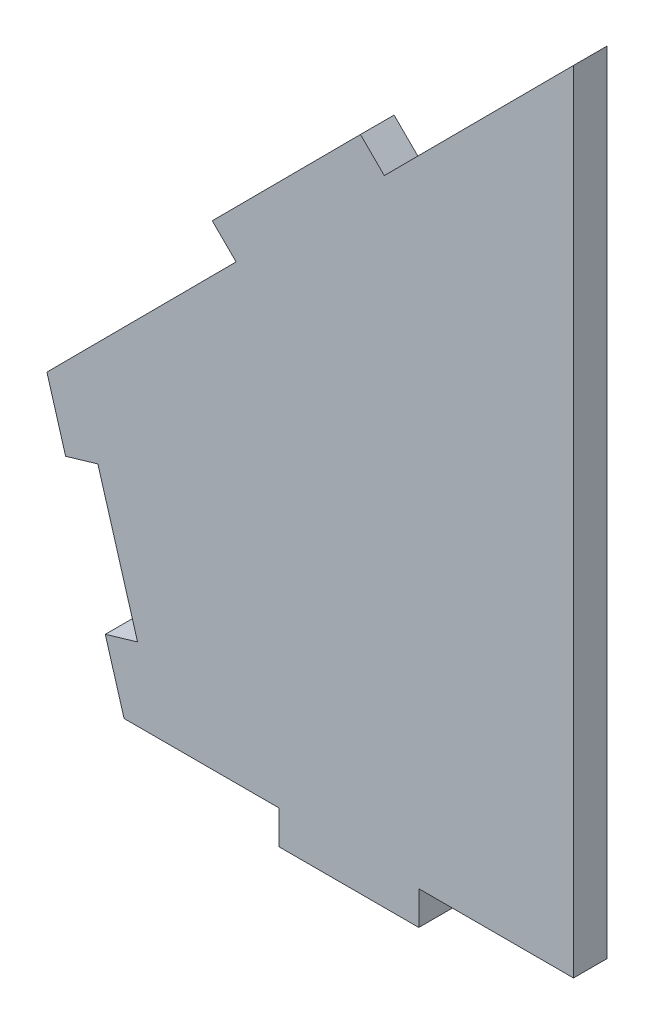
from build123d import *

# Parameters (mm, degrees)
BOSS_EXTRUDE1_DEPTH = 1.524


with BuildPart() as part:
    # Sketch1 → Boss-Extrude1 (new body)
    with BuildSketch(Plane.XY):
        Polygon((-17.902836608, 32.094077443), (-16.822878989, 31.018778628), (-25.401140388, 22.40335133), (-24.550527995, 19.521992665), (-23.088888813, 19.953486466), (-21.290997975, 13.863323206), (-22.752637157, 13.431829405), (-21.902024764, 10.550470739), (-14.888012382, 10.550470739), (-14.888012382, 9.026470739), (-8.538012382, 9.026470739), (-8.538012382, 10.550470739), (-1.524, 10.550470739), (-1.524, 19.433233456), (-1.524, 46.383941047), (-10.102261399, 37.76851375), (-11.182219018, 38.843812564), align=None)
    extrude(amount=BOSS_EXTRUDE1_DEPTH)


solid = part.part
